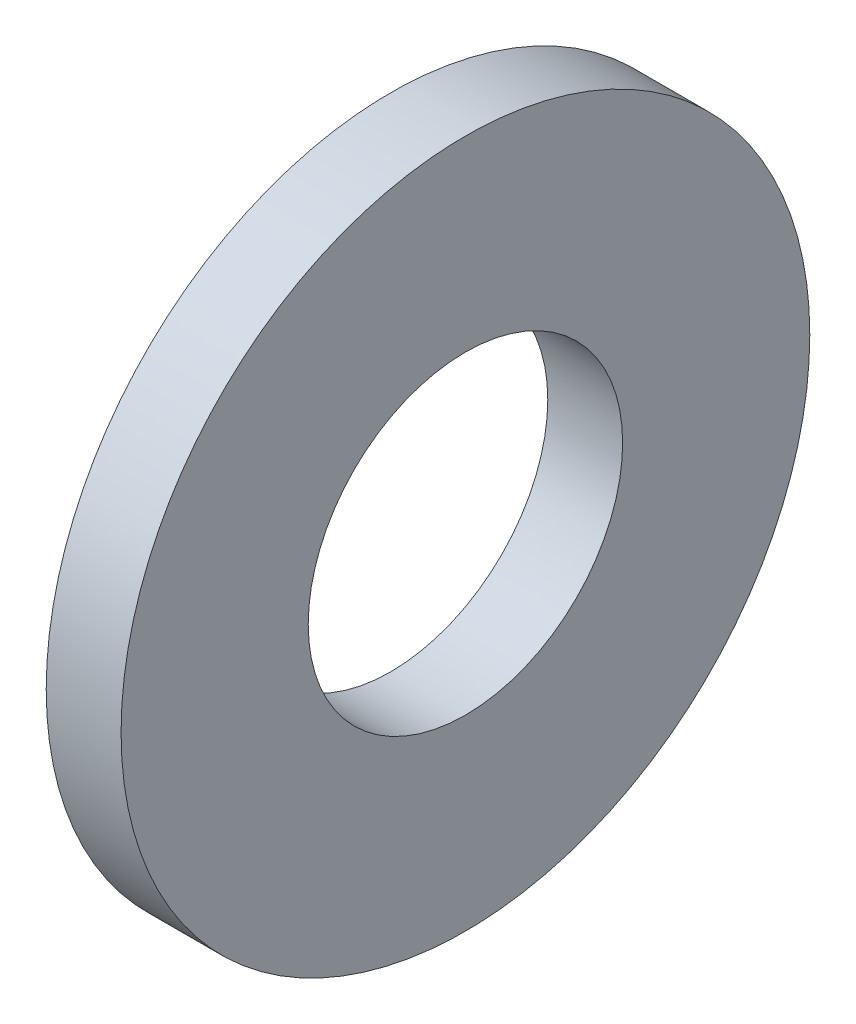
ISO-10303-21;
HEADER;
FILE_DESCRIPTION(('STEP AP214'),'2;1');
FILE_NAME('part.step','',(''),(''),'','','');
FILE_SCHEMA(('AUTOMOTIVE_DESIGN { 1 0 10303 214 1 1 1 1 }'));
ENDSEC;
DATA;
#1=APPLICATION_CONTEXT('core data for automotive mechanical design processes');
#2=APPLICATION_PROTOCOL_DEFINITION('international standard','automotive_design',2000,#1);
#3=PRODUCT_CONTEXT('',#1,'mechanical');
#4=PRODUCT('Part','Part','',(#3));
#5=PRODUCT_RELATED_PRODUCT_CATEGORY('part','',(#4));
#6=PRODUCT_DEFINITION_FORMATION('','',#4);
#7=PRODUCT_DEFINITION_CONTEXT('part definition',#1,'design');
#8=PRODUCT_DEFINITION('design','',#6,#7);
#9=PRODUCT_DEFINITION_SHAPE('','',#8);
#10=(LENGTH_UNIT() NAMED_UNIT(*) SI_UNIT(.MILLI.,.METRE.));
#11=(NAMED_UNIT(*) PLANE_ANGLE_UNIT() SI_UNIT($,.RADIAN.));
#12=(NAMED_UNIT(*) SI_UNIT($,.STERADIAN.) SOLID_ANGLE_UNIT());
#13=UNCERTAINTY_MEASURE_WITH_UNIT(LENGTH_MEASURE(1.E-05),#10,'distance_accuracy_value','');
#14=(GEOMETRIC_REPRESENTATION_CONTEXT(3) GLOBAL_UNCERTAINTY_ASSIGNED_CONTEXT((#13)) GLOBAL_UNIT_ASSIGNED_CONTEXT((#10,
#11,#12)) REPRESENTATION_CONTEXT('',''));
#15=CARTESIAN_POINT('',(0.,0.,0.));
#16=DIRECTION('',(0.,0.,1.));
#17=DIRECTION('',(1.,0.,0.));
#18=AXIS2_PLACEMENT_3D('',#15,#16,#17);
#19=CARTESIAN_POINT('',(2.5,0.,0.));
#20=DIRECTION('',(1.,0.,0.));
#21=DIRECTION('',(0.,0.,-1.));
#22=AXIS2_PLACEMENT_3D('',#19,#20,#21);
#23=PLANE('',#22);
#24=CARTESIAN_POINT('',(2.5,0.,0.));
#25=DIRECTION('',(1.,0.,0.));
#26=DIRECTION('',(0.,0.,-1.));
#27=AXIS2_PLACEMENT_3D('',#24,#25,#26);
#28=CIRCLE('',#27,11.5);
#29=CARTESIAN_POINT('',(2.5,0.,-11.5));
#30=VERTEX_POINT('',#29);
#31=EDGE_CURVE('E10',#30,#30,#28,.T.);
#32=ORIENTED_EDGE('',*,*,#31,.T.);
#33=EDGE_LOOP('',(#32));
#34=FACE_BOUND('',#33,.T.);
#35=CARTESIAN_POINT('',(2.5,0.,0.));
#36=DIRECTION('',(1.,0.,0.));
#37=DIRECTION('',(0.,0.,-1.));
#38=AXIS2_PLACEMENT_3D('',#35,#36,#37);
#39=CIRCLE('',#38,5.25);
#40=CARTESIAN_POINT('',(2.5,0.,-5.25));
#41=VERTEX_POINT('',#40);
#42=EDGE_CURVE('E48',#41,#41,#39,.T.);
#43=ORIENTED_EDGE('',*,*,#42,.F.);
#44=EDGE_LOOP('',(#43));
#45=FACE_BOUND('',#44,.T.);
#46=ADVANCED_FACE('F37',(#34,#45),#23,.T.);
#47=CARTESIAN_POINT('',(0.,0.,0.));
#48=DIRECTION('',(1.,0.,0.));
#49=DIRECTION('',(0.,0.,-1.));
#50=AXIS2_PLACEMENT_3D('',#47,#48,#49);
#51=PLANE('',#50);
#52=CARTESIAN_POINT('',(0.,0.,0.));
#53=DIRECTION('',(1.,0.,0.));
#54=DIRECTION('',(0.,0.,-1.));
#55=AXIS2_PLACEMENT_3D('',#52,#53,#54);
#56=CIRCLE('',#55,11.5);
#57=CARTESIAN_POINT('',(0.,0.,-11.5));
#58=VERTEX_POINT('',#57);
#59=EDGE_CURVE('E41',#58,#58,#56,.T.);
#60=ORIENTED_EDGE('',*,*,#59,.F.);
#61=EDGE_LOOP('',(#60));
#62=FACE_BOUND('',#61,.T.);
#63=CARTESIAN_POINT('',(0.,0.,0.));
#64=DIRECTION('',(1.,0.,0.));
#65=DIRECTION('',(0.,0.,-1.));
#66=AXIS2_PLACEMENT_3D('',#63,#64,#65);
#67=CIRCLE('',#66,5.25);
#68=CARTESIAN_POINT('',(0.,0.,-5.25));
#69=VERTEX_POINT('',#68);
#70=EDGE_CURVE('E50',#69,#69,#67,.T.);
#71=ORIENTED_EDGE('',*,*,#70,.T.);
#72=EDGE_LOOP('',(#71));
#73=FACE_BOUND('',#72,.T.);
#74=ADVANCED_FACE('F60',(#62,#73),#51,.F.);
#75=CARTESIAN_POINT('',(2.5,0.,0.));
#76=DIRECTION('',(-1.,0.,0.));
#77=DIRECTION('',(0.,0.,1.));
#78=AXIS2_PLACEMENT_3D('',#75,#76,#77);
#79=CYLINDRICAL_SURFACE('',#78,11.5);
#80=ORIENTED_EDGE('',*,*,#31,.F.);
#81=EDGE_LOOP('',(#80));
#82=FACE_BOUND('',#81,.T.);
#83=ORIENTED_EDGE('',*,*,#59,.T.);
#84=EDGE_LOOP('',(#83));
#85=FACE_BOUND('',#84,.T.);
#86=ADVANCED_FACE('F39',(#82,#85),#79,.T.);
#87=CARTESIAN_POINT('',(2.5,0.,0.));
#88=DIRECTION('',(-1.,0.,0.));
#89=DIRECTION('',(0.,0.,1.));
#90=AXIS2_PLACEMENT_3D('',#87,#88,#89);
#91=CYLINDRICAL_SURFACE('',#90,5.25);
#92=ORIENTED_EDGE('',*,*,#42,.T.);
#93=EDGE_LOOP('',(#92));
#94=FACE_BOUND('',#93,.T.);
#95=ORIENTED_EDGE('',*,*,#70,.F.);
#96=EDGE_LOOP('',(#95));
#97=FACE_BOUND('',#96,.T.);
#98=ADVANCED_FACE('F56',(#94,#97),#91,.F.);
#99=CLOSED_SHELL('',(#46,#74,#86,#98));
#100=MANIFOLD_SOLID_BREP('B2',#99);
#101=ADVANCED_BREP_SHAPE_REPRESENTATION('',(#18,#100),#14);
#102=SHAPE_DEFINITION_REPRESENTATION(#9,#101);
ENDSEC;
END-ISO-10303-21;
